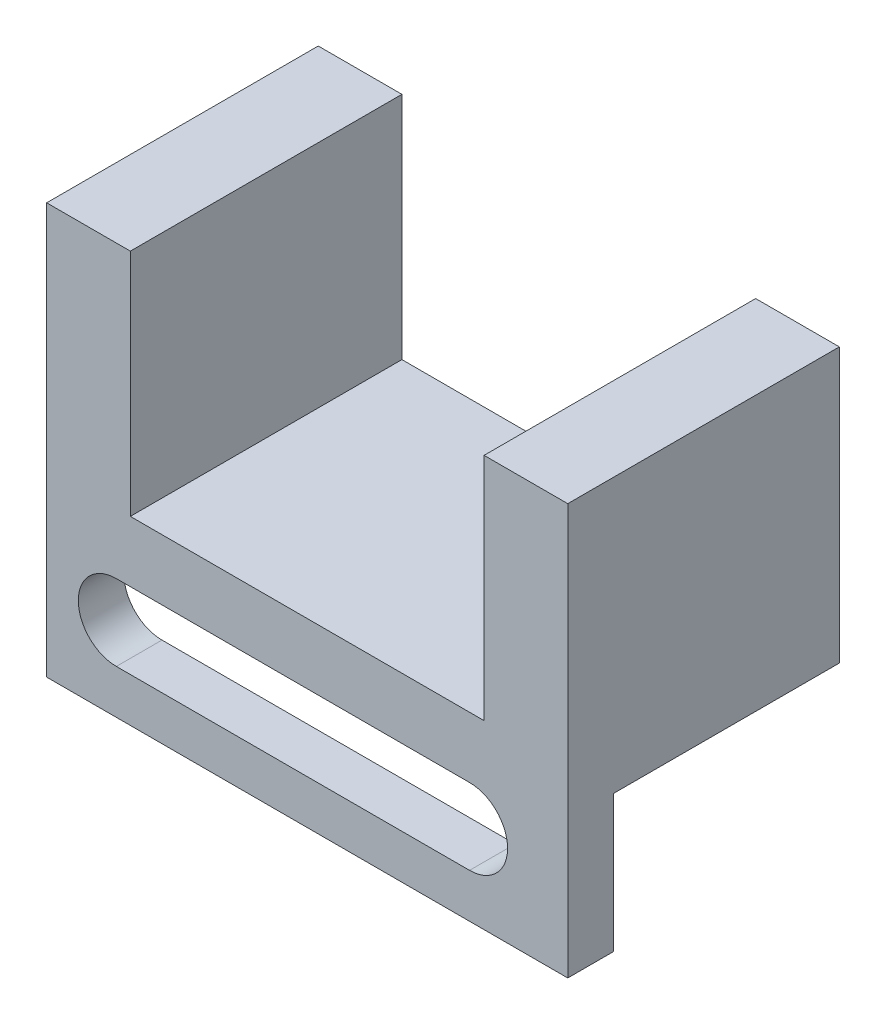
ISO-10303-21;
HEADER;
FILE_DESCRIPTION(('STEP AP214'),'2;1');
FILE_NAME('part.step','',(''),(''),'','','');
FILE_SCHEMA(('AUTOMOTIVE_DESIGN { 1 0 10303 214 1 1 1 1 }'));
ENDSEC;
DATA;
#1=APPLICATION_CONTEXT('core data for automotive mechanical design processes');
#2=APPLICATION_PROTOCOL_DEFINITION('international standard','automotive_design',2000,#1);
#3=PRODUCT_CONTEXT('',#1,'mechanical');
#4=PRODUCT('Part','Part','',(#3));
#5=PRODUCT_RELATED_PRODUCT_CATEGORY('part','',(#4));
#6=PRODUCT_DEFINITION_FORMATION('','',#4);
#7=PRODUCT_DEFINITION_CONTEXT('part definition',#1,'design');
#8=PRODUCT_DEFINITION('design','',#6,#7);
#9=PRODUCT_DEFINITION_SHAPE('','',#8);
#10=(LENGTH_UNIT() NAMED_UNIT(*) SI_UNIT(.MILLI.,.METRE.));
#11=(NAMED_UNIT(*) PLANE_ANGLE_UNIT() SI_UNIT($,.RADIAN.));
#12=(NAMED_UNIT(*) SI_UNIT($,.STERADIAN.) SOLID_ANGLE_UNIT());
#13=UNCERTAINTY_MEASURE_WITH_UNIT(LENGTH_MEASURE(1.E-05),#10,'distance_accuracy_value','');
#14=(GEOMETRIC_REPRESENTATION_CONTEXT(3) GLOBAL_UNCERTAINTY_ASSIGNED_CONTEXT((#13)) GLOBAL_UNIT_ASSIGNED_CONTEXT((#10,
#11,#12)) REPRESENTATION_CONTEXT('',''));
#15=CARTESIAN_POINT('',(0.,0.,0.));
#16=DIRECTION('',(0.,0.,1.));
#17=DIRECTION('',(1.,0.,0.));
#18=AXIS2_PLACEMENT_3D('',#15,#16,#17);
#19=CARTESIAN_POINT('',(40.3169177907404,78.6,-127.550100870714));
#20=DIRECTION('',(0.,1.,0.));
#21=DIRECTION('',(0.,0.,1.));
#22=AXIS2_PLACEMENT_3D('',#19,#20,#21);
#23=PLANE('',#22);
#24=DIRECTION('',(1.,0.,0.));
#25=VECTOR('',#24,1.);
#26=CARTESIAN_POINT('',(74.5669177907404,78.6,-73.6082089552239));
#27=LINE('',#26,#25);
#28=CARTESIAN_POINT('',(40.3169177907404,78.6,-73.6082089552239));
#29=VERTEX_POINT('',#28);
#30=CARTESIAN_POINT('',(74.5669177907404,78.6,-73.6082089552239));
#31=VERTEX_POINT('',#30);
#32=EDGE_CURVE('E64',#29,#31,#27,.T.);
#33=ORIENTED_EDGE('',*,*,#32,.F.);
#34=DIRECTION('',(0.,0.,1.));
#35=VECTOR('',#34,1.);
#36=CARTESIAN_POINT('',(40.3169177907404,78.6,-127.550100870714));
#37=LINE('',#36,#35);
#38=CARTESIAN_POINT('',(40.3169177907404,78.6,-88.4582089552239));
#39=VERTEX_POINT('',#38);
#40=EDGE_CURVE('E265',#39,#29,#37,.T.);
#41=ORIENTED_EDGE('',*,*,#40,.F.);
#42=DIRECTION('',(-1.,0.,0.));
#43=VECTOR('',#42,1.);
#44=CARTESIAN_POINT('',(40.3169177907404,78.6,-88.4582089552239));
#45=LINE('',#44,#43);
#46=CARTESIAN_POINT('',(74.5669177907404,78.6,-88.4582089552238));
#47=VERTEX_POINT('',#46);
#48=EDGE_CURVE('E287',#47,#39,#45,.T.);
#49=ORIENTED_EDGE('',*,*,#48,.F.);
#50=DIRECTION('',(0.,0.,1.));
#51=VECTOR('',#50,1.);
#52=CARTESIAN_POINT('',(74.5669177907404,78.6,-127.550100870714));
#53=LINE('',#52,#51);
#54=EDGE_CURVE('E269',#47,#31,#53,.T.);
#55=ORIENTED_EDGE('',*,*,#54,.T.);
#56=EDGE_LOOP('',(#33,#41,#49,#55));
#57=FACE_BOUND('',#56,.T.);
#58=ADVANCED_FACE('F46',(#57),#23,.F.);
#59=CARTESIAN_POINT('',(69.0669177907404,81.5,-127.550100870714));
#60=DIRECTION('',(1.,0.,0.));
#61=DIRECTION('',(0.,0.,-1.));
#62=AXIS2_PLACEMENT_3D('',#59,#60,#61);
#63=PLANE('',#62);
#64=DIRECTION('',(0.,1.,0.));
#65=VECTOR('',#64,1.);
#66=CARTESIAN_POINT('',(69.0669177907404,81.5,-88.4582089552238));
#67=LINE('',#66,#65);
#68=CARTESIAN_POINT('',(69.0669177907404,81.5,-88.4582089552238));
#69=VERTEX_POINT('',#68);
#70=CARTESIAN_POINT('',(69.0669177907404,96.6,-88.4582089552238));
#71=VERTEX_POINT('',#70);
#72=EDGE_CURVE('E299',#69,#71,#67,.T.);
#73=ORIENTED_EDGE('',*,*,#72,.F.);
#74=DIRECTION('',(0.,0.,1.));
#75=VECTOR('',#74,1.);
#76=CARTESIAN_POINT('',(69.0669177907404,81.5,-127.550100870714));
#77=LINE('',#76,#75);
#78=CARTESIAN_POINT('',(69.0669177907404,81.5,-70.6082089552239));
#79=VERTEX_POINT('',#78);
#80=EDGE_CURVE('E50',#69,#79,#77,.T.);
#81=ORIENTED_EDGE('',*,*,#80,.T.);
#82=DIRECTION('',(0.,1.,0.));
#83=VECTOR('',#82,1.);
#84=CARTESIAN_POINT('',(69.0669177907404,81.5,-70.6082089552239));
#85=LINE('',#84,#83);
#86=CARTESIAN_POINT('',(69.0669177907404,96.6,-70.6082089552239));
#87=VERTEX_POINT('',#86);
#88=EDGE_CURVE('E276',#79,#87,#85,.T.);
#89=ORIENTED_EDGE('',*,*,#88,.T.);
#90=DIRECTION('',(0.,0.,1.));
#91=VECTOR('',#90,1.);
#92=CARTESIAN_POINT('',(69.0669177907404,96.6,-127.550100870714));
#93=LINE('',#92,#91);
#94=EDGE_CURVE('E275',#71,#87,#93,.T.);
#95=ORIENTED_EDGE('',*,*,#94,.F.);
#96=EDGE_LOOP('',(#73,#81,#89,#95));
#97=FACE_BOUND('',#96,.T.);
#98=ADVANCED_FACE('F333',(#97),#63,.F.);
#99=CARTESIAN_POINT('',(74.5669177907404,96.6,-127.550100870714));
#100=DIRECTION('',(0.,-1.,0.));
#101=DIRECTION('',(0.,0.,-1.));
#102=AXIS2_PLACEMENT_3D('',#99,#100,#101);
#103=PLANE('',#102);
#104=DIRECTION('',(1.,0.,0.));
#105=VECTOR('',#104,1.);
#106=CARTESIAN_POINT('',(74.5669177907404,96.6,-88.4582089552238));
#107=LINE('',#106,#105);
#108=CARTESIAN_POINT('',(74.5669177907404,96.6,-88.4582089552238));
#109=VERTEX_POINT('',#108);
#110=EDGE_CURVE('E295',#71,#109,#107,.T.);
#111=ORIENTED_EDGE('',*,*,#110,.F.);
#112=ORIENTED_EDGE('',*,*,#94,.T.);
#113=DIRECTION('',(1.,0.,0.));
#114=VECTOR('',#113,1.);
#115=CARTESIAN_POINT('',(74.5669177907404,96.6,-70.6082089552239));
#116=LINE('',#115,#114);
#117=CARTESIAN_POINT('',(74.5669177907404,96.6,-70.6082089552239));
#118=VERTEX_POINT('',#117);
#119=EDGE_CURVE('E271',#87,#118,#116,.T.);
#120=ORIENTED_EDGE('',*,*,#119,.T.);
#121=DIRECTION('',(0.,0.,1.));
#122=VECTOR('',#121,1.);
#123=CARTESIAN_POINT('',(74.5669177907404,96.6,-127.550100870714));
#124=LINE('',#123,#122);
#125=EDGE_CURVE('E270',#109,#118,#124,.T.);
#126=ORIENTED_EDGE('',*,*,#125,.F.);
#127=EDGE_LOOP('',(#111,#112,#120,#126));
#128=FACE_BOUND('',#127,.T.);
#129=ADVANCED_FACE('F354',(#128),#103,.F.);
#130=CARTESIAN_POINT('',(74.5669177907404,78.6,-127.550100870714));
#131=DIRECTION('',(-1.,0.,0.));
#132=DIRECTION('',(0.,0.,1.));
#133=AXIS2_PLACEMENT_3D('',#130,#131,#132);
#134=PLANE('',#133);
#135=DIRECTION('',(0.,-1.,0.));
#136=VECTOR('',#135,1.);
#137=CARTESIAN_POINT('',(74.5669177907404,78.6,-88.4582089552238));
#138=LINE('',#137,#136);
#139=EDGE_CURVE('E291',#109,#47,#138,.T.);
#140=ORIENTED_EDGE('',*,*,#139,.F.);
#141=ORIENTED_EDGE('',*,*,#125,.T.);
#142=DIRECTION('',(0.,-1.,0.));
#143=VECTOR('',#142,1.);
#144=CARTESIAN_POINT('',(74.5669177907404,78.6,-70.6082089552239));
#145=LINE('',#144,#143);
#146=CARTESIAN_POINT('',(74.5669177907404,69.6,-70.6082089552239));
#147=VERTEX_POINT('',#146);
#148=EDGE_CURVE('E266',#118,#147,#145,.T.);
#149=ORIENTED_EDGE('',*,*,#148,.T.);
#150=DIRECTION('',(0.,0.,1.));
#151=VECTOR('',#150,1.);
#152=CARTESIAN_POINT('',(74.5669177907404,69.6,-73.6082089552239));
#153=LINE('',#152,#151);
#154=CARTESIAN_POINT('',(74.5669177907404,69.6,-73.6082089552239));
#155=VERTEX_POINT('',#154);
#156=EDGE_CURVE('E226',#155,#147,#153,.T.);
#157=ORIENTED_EDGE('',*,*,#156,.F.);
#158=DIRECTION('',(0.,-1.,0.));
#159=VECTOR('',#158,1.);
#160=CARTESIAN_POINT('',(74.5669177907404,78.6,-73.6082089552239));
#161=LINE('',#160,#159);
#162=EDGE_CURVE('E206',#31,#155,#161,.T.);
#163=ORIENTED_EDGE('',*,*,#162,.F.);
#164=ORIENTED_EDGE('',*,*,#54,.F.);
#165=EDGE_LOOP('',(#140,#141,#149,#157,#163,#164));
#166=FACE_BOUND('',#165,.T.);
#167=ADVANCED_FACE('F351',(#166),#134,.F.);
#168=CARTESIAN_POINT('',(40.3169177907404,96.6,-127.550100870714));
#169=DIRECTION('',(1.,0.,0.));
#170=DIRECTION('',(0.,1.,0.));
#171=AXIS2_PLACEMENT_3D('',#168,#169,#170);
#172=PLANE('',#171);
#173=DIRECTION('',(0.,1.,0.));
#174=VECTOR('',#173,1.);
#175=CARTESIAN_POINT('',(40.3169177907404,96.6,-88.4582089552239));
#176=LINE('',#175,#174);
#177=CARTESIAN_POINT('',(40.3169177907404,96.6,-88.4582089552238));
#178=VERTEX_POINT('',#177);
#179=EDGE_CURVE('E283',#39,#178,#176,.T.);
#180=ORIENTED_EDGE('',*,*,#179,.F.);
#181=ORIENTED_EDGE('',*,*,#40,.T.);
#182=DIRECTION('',(0.,1.,0.));
#183=VECTOR('',#182,1.);
#184=CARTESIAN_POINT('',(40.3169177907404,78.6,-73.6082089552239));
#185=LINE('',#184,#183);
#186=CARTESIAN_POINT('',(40.3169177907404,69.6,-73.6082089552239));
#187=VERTEX_POINT('',#186);
#188=EDGE_CURVE('E213',#187,#29,#185,.T.);
#189=ORIENTED_EDGE('',*,*,#188,.F.);
#190=DIRECTION('',(0.,0.,1.));
#191=VECTOR('',#190,1.);
#192=CARTESIAN_POINT('',(40.3169177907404,69.6,-73.6082089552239));
#193=LINE('',#192,#191);
#194=CARTESIAN_POINT('',(40.3169177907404,69.6,-70.6082089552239));
#195=VERTEX_POINT('',#194);
#196=EDGE_CURVE('E219',#187,#195,#193,.T.);
#197=ORIENTED_EDGE('',*,*,#196,.T.);
#198=DIRECTION('',(0.,1.,0.));
#199=VECTOR('',#198,1.);
#200=CARTESIAN_POINT('',(40.3169177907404,96.6,-70.6082089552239));
#201=LINE('',#200,#199);
#202=CARTESIAN_POINT('',(40.3169177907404,96.6,-70.6082089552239));
#203=VERTEX_POINT('',#202);
#204=EDGE_CURVE('E261',#195,#203,#201,.T.);
#205=ORIENTED_EDGE('',*,*,#204,.T.);
#206=DIRECTION('',(0.,0.,1.));
#207=VECTOR('',#206,1.);
#208=CARTESIAN_POINT('',(40.3169177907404,96.6,-127.550100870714));
#209=LINE('',#208,#207);
#210=EDGE_CURVE('E260',#178,#203,#209,.T.);
#211=ORIENTED_EDGE('',*,*,#210,.F.);
#212=EDGE_LOOP('',(#180,#181,#189,#197,#205,#211));
#213=FACE_BOUND('',#212,.T.);
#214=ADVANCED_FACE('F346',(#213),#172,.F.);
#215=CARTESIAN_POINT('',(45.8169177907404,96.6,-127.550100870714));
#216=DIRECTION('',(0.,-1.,0.));
#217=DIRECTION('',(0.,0.,-1.));
#218=AXIS2_PLACEMENT_3D('',#215,#216,#217);
#219=PLANE('',#218);
#220=DIRECTION('',(1.,0.,0.));
#221=VECTOR('',#220,1.);
#222=CARTESIAN_POINT('',(45.8169177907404,96.6,-88.4582089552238));
#223=LINE('',#222,#221);
#224=CARTESIAN_POINT('',(45.8169177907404,96.6,-88.4582089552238));
#225=VERTEX_POINT('',#224);
#226=EDGE_CURVE('E56',#178,#225,#223,.T.);
#227=ORIENTED_EDGE('',*,*,#226,.F.);
#228=ORIENTED_EDGE('',*,*,#210,.T.);
#229=DIRECTION('',(1.,0.,0.));
#230=VECTOR('',#229,1.);
#231=CARTESIAN_POINT('',(45.8169177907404,96.6,-70.6082089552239));
#232=LINE('',#231,#230);
#233=CARTESIAN_POINT('',(45.8169177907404,96.6,-70.6082089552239));
#234=VERTEX_POINT('',#233);
#235=EDGE_CURVE('E256',#203,#234,#232,.T.);
#236=ORIENTED_EDGE('',*,*,#235,.T.);
#237=DIRECTION('',(0.,0.,1.));
#238=VECTOR('',#237,1.);
#239=CARTESIAN_POINT('',(45.8169177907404,96.6,-127.550100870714));
#240=LINE('',#239,#238);
#241=EDGE_CURVE('E255',#225,#234,#240,.T.);
#242=ORIENTED_EDGE('',*,*,#241,.F.);
#243=EDGE_LOOP('',(#227,#228,#236,#242));
#244=FACE_BOUND('',#243,.T.);
#245=ADVANCED_FACE('F337',(#244),#219,.F.);
#246=CARTESIAN_POINT('',(45.8169177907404,81.5,-127.550100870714));
#247=DIRECTION('',(-1.,0.,0.));
#248=DIRECTION('',(0.,0.,1.));
#249=AXIS2_PLACEMENT_3D('',#246,#247,#248);
#250=PLANE('',#249);
#251=DIRECTION('',(0.,-1.,0.));
#252=VECTOR('',#251,1.);
#253=CARTESIAN_POINT('',(45.8169177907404,81.5,-88.4582089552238));
#254=LINE('',#253,#252);
#255=CARTESIAN_POINT('',(45.8169177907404,81.5,-88.4582089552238));
#256=VERTEX_POINT('',#255);
#257=EDGE_CURVE('E12',#225,#256,#254,.T.);
#258=ORIENTED_EDGE('',*,*,#257,.F.);
#259=ORIENTED_EDGE('',*,*,#241,.T.);
#260=DIRECTION('',(0.,-1.,0.));
#261=VECTOR('',#260,1.);
#262=CARTESIAN_POINT('',(45.8169177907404,81.5,-70.6082089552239));
#263=LINE('',#262,#261);
#264=CARTESIAN_POINT('',(45.8169177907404,81.5,-70.6082089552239));
#265=VERTEX_POINT('',#264);
#266=EDGE_CURVE('E251',#234,#265,#263,.T.);
#267=ORIENTED_EDGE('',*,*,#266,.T.);
#268=DIRECTION('',(0.,0.,1.));
#269=VECTOR('',#268,1.);
#270=CARTESIAN_POINT('',(45.8169177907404,81.5,-127.550100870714));
#271=LINE('',#270,#269);
#272=EDGE_CURVE('E250',#256,#265,#271,.T.);
#273=ORIENTED_EDGE('',*,*,#272,.F.);
#274=EDGE_LOOP('',(#258,#259,#267,#273));
#275=FACE_BOUND('',#274,.T.);
#276=ADVANCED_FACE('F323',(#275),#250,.F.);
#277=CARTESIAN_POINT('',(69.0669177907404,81.5,-127.550100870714));
#278=DIRECTION('',(0.,-1.,0.));
#279=DIRECTION('',(0.,0.,-1.));
#280=AXIS2_PLACEMENT_3D('',#277,#278,#279);
#281=PLANE('',#280);
#282=DIRECTION('',(1.,0.,0.));
#283=VECTOR('',#282,1.);
#284=CARTESIAN_POINT('',(69.0669177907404,81.5,-88.4582089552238));
#285=LINE('',#284,#283);
#286=EDGE_CURVE('E249',#256,#69,#285,.T.);
#287=ORIENTED_EDGE('',*,*,#286,.F.);
#288=ORIENTED_EDGE('',*,*,#272,.T.);
#289=DIRECTION('',(1.,0.,0.));
#290=VECTOR('',#289,1.);
#291=CARTESIAN_POINT('',(69.0669177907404,81.5,-70.6082089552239));
#292=LINE('',#291,#290);
#293=EDGE_CURVE('E246',#265,#79,#292,.T.);
#294=ORIENTED_EDGE('',*,*,#293,.T.);
#295=ORIENTED_EDGE('',*,*,#80,.F.);
#296=EDGE_LOOP('',(#287,#288,#294,#295));
#297=FACE_BOUND('',#296,.T.);
#298=ADVANCED_FACE('F318',(#297),#281,.F.);
#299=CARTESIAN_POINT('',(0.,0.,-70.6082089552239));
#300=DIRECTION('',(0.,0.,1.));
#301=DIRECTION('',(1.,0.,0.));
#302=AXIS2_PLACEMENT_3D('',#299,#300,#301);
#303=PLANE('',#302);
#304=ORIENTED_EDGE('',*,*,#88,.F.);
#305=ORIENTED_EDGE('',*,*,#293,.F.);
#306=ORIENTED_EDGE('',*,*,#266,.F.);
#307=ORIENTED_EDGE('',*,*,#235,.F.);
#308=ORIENTED_EDGE('',*,*,#204,.F.);
#309=DIRECTION('',(-1.,0.,0.));
#310=VECTOR('',#309,1.);
#311=CARTESIAN_POINT('',(74.5669177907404,69.6,-70.6082089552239));
#312=LINE('',#311,#310);
#313=EDGE_CURVE('E172',#147,#195,#312,.T.);
#314=ORIENTED_EDGE('',*,*,#313,.F.);
#315=ORIENTED_EDGE('',*,*,#148,.F.);
#316=ORIENTED_EDGE('',*,*,#119,.F.);
#317=EDGE_LOOP('',(#304,#305,#306,#307,#308,#314,#315,#316));
#318=FACE_BOUND('',#317,.T.);
#319=CARTESIAN_POINT('',(68.1119402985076,75.,-70.6082089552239));
#320=DIRECTION('',(0.,0.,-1.));
#321=DIRECTION('',(-1.,0.,0.));
#322=AXIS2_PLACEMENT_3D('',#319,#320,#321);
#323=CIRCLE('',#322,2.49999999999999);
#324=CARTESIAN_POINT('',(68.1119402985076,77.5,-70.6082089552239));
#325=VERTEX_POINT('',#324);
#326=CARTESIAN_POINT('',(68.1119402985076,72.5,-70.6082089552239));
#327=VERTEX_POINT('',#326);
#328=EDGE_CURVE('E187',#325,#327,#323,.T.);
#329=ORIENTED_EDGE('',*,*,#328,.T.);
#330=DIRECTION('',(-1.,0.,0.));
#331=VECTOR('',#330,1.);
#332=CARTESIAN_POINT('',(68.1119402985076,72.5,-70.6082089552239));
#333=LINE('',#332,#331);
#334=CARTESIAN_POINT('',(44.8968282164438,72.5,-70.6082089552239));
#335=VERTEX_POINT('',#334);
#336=EDGE_CURVE('E170',#327,#335,#333,.T.);
#337=ORIENTED_EDGE('',*,*,#336,.T.);
#338=CARTESIAN_POINT('',(44.8968282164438,75.,-70.6082089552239));
#339=DIRECTION('',(0.,0.,-1.));
#340=DIRECTION('',(-1.,0.,0.));
#341=AXIS2_PLACEMENT_3D('',#338,#339,#340);
#342=CIRCLE('',#341,2.49999999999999);
#343=CARTESIAN_POINT('',(44.8968282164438,77.5,-70.6082089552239));
#344=VERTEX_POINT('',#343);
#345=EDGE_CURVE('E192',#335,#344,#342,.T.);
#346=ORIENTED_EDGE('',*,*,#345,.T.);
#347=DIRECTION('',(1.,0.,0.));
#348=VECTOR('',#347,1.);
#349=CARTESIAN_POINT('',(68.1119402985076,77.5,-70.6082089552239));
#350=LINE('',#349,#348);
#351=EDGE_CURVE('E164',#344,#325,#350,.T.);
#352=ORIENTED_EDGE('',*,*,#351,.T.);
#353=EDGE_LOOP('',(#329,#337,#346,#352));
#354=FACE_BOUND('',#353,.T.);
#355=ADVANCED_FACE('F327',(#318,#354),#303,.T.);
#356=CARTESIAN_POINT('',(46.0669177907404,94.25,-88.4582089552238));
#357=DIRECTION('',(0.,0.,-1.));
#358=DIRECTION('',(0.,1.,0.));
#359=AXIS2_PLACEMENT_3D('',#356,#357,#358);
#360=PLANE('',#359);
#361=CARTESIAN_POINT('',(43.7419177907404,88.,-88.4582089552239));
#362=DIRECTION('',(0.,0.,-1.));
#363=DIRECTION('',(-1.,0.,0.));
#364=AXIS2_PLACEMENT_3D('',#361,#362,#363);
#365=CIRCLE('',#364,0.999999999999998);
#366=CARTESIAN_POINT('',(42.7419177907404,88.,-88.4582089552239));
#367=VERTEX_POINT('',#366);
#368=EDGE_CURVE('E235',#367,#367,#365,.T.);
#369=ORIENTED_EDGE('',*,*,#368,.F.);
#370=EDGE_LOOP('',(#369));
#371=FACE_BOUND('',#370,.T.);
#372=CARTESIAN_POINT('',(71.1419177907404,88.,-88.4582089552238));
#373=DIRECTION('',(0.,0.,-1.));
#374=DIRECTION('',(-1.,0.,0.));
#375=AXIS2_PLACEMENT_3D('',#372,#373,#374);
#376=CIRCLE('',#375,0.999999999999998);
#377=CARTESIAN_POINT('',(70.1419177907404,88.,-88.4582089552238));
#378=VERTEX_POINT('',#377);
#379=EDGE_CURVE('E239',#378,#378,#376,.T.);
#380=ORIENTED_EDGE('',*,*,#379,.F.);
#381=EDGE_LOOP('',(#380));
#382=FACE_BOUND('',#381,.T.);
#383=ORIENTED_EDGE('',*,*,#286,.T.);
#384=ORIENTED_EDGE('',*,*,#72,.T.);
#385=ORIENTED_EDGE('',*,*,#110,.T.);
#386=ORIENTED_EDGE('',*,*,#139,.T.);
#387=ORIENTED_EDGE('',*,*,#48,.T.);
#388=ORIENTED_EDGE('',*,*,#179,.T.);
#389=ORIENTED_EDGE('',*,*,#226,.T.);
#390=ORIENTED_EDGE('',*,*,#257,.T.);
#391=EDGE_LOOP('',(#383,#384,#385,#386,#387,#388,#389,#390));
#392=FACE_BOUND('',#391,.T.);
#393=ADVANCED_FACE('F48',(#371,#382,#392),#360,.T.);
#394=CARTESIAN_POINT('',(71.1419177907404,88.,-78.4582089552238));
#395=DIRECTION('',(0.,0.,-1.));
#396=DIRECTION('',(-1.,0.,0.));
#397=AXIS2_PLACEMENT_3D('',#394,#395,#396);
#398=CYLINDRICAL_SURFACE('',#397,0.999999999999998);
#399=CARTESIAN_POINT('',(71.1419177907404,88.,-78.4582089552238));
#400=DIRECTION('',(0.,0.,-1.));
#401=DIRECTION('',(-1.,0.,0.));
#402=AXIS2_PLACEMENT_3D('',#399,#400,#401);
#403=CIRCLE('',#402,0.999999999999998);
#404=CARTESIAN_POINT('',(70.1419177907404,88.,-78.4582089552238));
#405=VERTEX_POINT('',#404);
#406=EDGE_CURVE('E230',#405,#405,#403,.T.);
#407=ORIENTED_EDGE('',*,*,#406,.F.);
#408=EDGE_LOOP('',(#407));
#409=FACE_BOUND('',#408,.T.);
#410=ORIENTED_EDGE('',*,*,#379,.T.);
#411=EDGE_LOOP('',(#410));
#412=FACE_BOUND('',#411,.T.);
#413=ADVANCED_FACE('F401',(#409,#412),#398,.F.);
#414=CARTESIAN_POINT('',(71.1419177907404,88.,-78.4582089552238));
#415=DIRECTION('',(0.,0.,-1.));
#416=DIRECTION('',(-1.,0.,0.));
#417=AXIS2_PLACEMENT_3D('',#414,#415,#416);
#418=PLANE('',#417);
#419=ORIENTED_EDGE('',*,*,#406,.T.);
#420=EDGE_LOOP('',(#419));
#421=FACE_BOUND('',#420,.T.);
#422=ADVANCED_FACE('F409',(#421),#418,.T.);
#423=CARTESIAN_POINT('',(43.7419177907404,88.,-78.4582089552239));
#424=DIRECTION('',(0.,0.,-1.));
#425=DIRECTION('',(-1.,0.,0.));
#426=AXIS2_PLACEMENT_3D('',#423,#424,#425);
#427=CYLINDRICAL_SURFACE('',#426,0.999999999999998);
#428=CARTESIAN_POINT('',(43.7419177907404,88.,-78.4582089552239));
#429=DIRECTION('',(0.,0.,-1.));
#430=DIRECTION('',(-1.,0.,0.));
#431=AXIS2_PLACEMENT_3D('',#428,#429,#430);
#432=CIRCLE('',#431,0.999999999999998);
#433=CARTESIAN_POINT('',(42.7419177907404,88.,-78.4582089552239));
#434=VERTEX_POINT('',#433);
#435=EDGE_CURVE('E231',#434,#434,#432,.T.);
#436=ORIENTED_EDGE('',*,*,#435,.F.);
#437=EDGE_LOOP('',(#436));
#438=FACE_BOUND('',#437,.T.);
#439=ORIENTED_EDGE('',*,*,#368,.T.);
#440=EDGE_LOOP('',(#439));
#441=FACE_BOUND('',#440,.T.);
#442=ADVANCED_FACE('F418',(#438,#441),#427,.F.);
#443=CARTESIAN_POINT('',(43.7419177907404,88.,-78.4582089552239));
#444=DIRECTION('',(0.,0.,-1.));
#445=DIRECTION('',(-1.,0.,0.));
#446=AXIS2_PLACEMENT_3D('',#443,#444,#445);
#447=PLANE('',#446);
#448=ORIENTED_EDGE('',*,*,#435,.T.);
#449=EDGE_LOOP('',(#448));
#450=FACE_BOUND('',#449,.T.);
#451=ADVANCED_FACE('F426',(#450),#447,.T.);
#452=CARTESIAN_POINT('',(0.,0.,-73.6082089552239));
#453=DIRECTION('',(0.,0.,-1.));
#454=DIRECTION('',(-1.,0.,0.));
#455=AXIS2_PLACEMENT_3D('',#452,#453,#454);
#456=PLANE('',#455);
#457=ORIENTED_EDGE('',*,*,#162,.T.);
#458=DIRECTION('',(-1.,0.,0.));
#459=VECTOR('',#458,1.);
#460=CARTESIAN_POINT('',(74.5669177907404,69.6,-73.6082089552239));
#461=LINE('',#460,#459);
#462=EDGE_CURVE('E210',#155,#187,#461,.T.);
#463=ORIENTED_EDGE('',*,*,#462,.T.);
#464=ORIENTED_EDGE('',*,*,#188,.T.);
#465=ORIENTED_EDGE('',*,*,#32,.T.);
#466=EDGE_LOOP('',(#457,#463,#464,#465));
#467=FACE_BOUND('',#466,.T.);
#468=DIRECTION('',(-1.,0.,0.));
#469=VECTOR('',#468,1.);
#470=CARTESIAN_POINT('',(68.1119402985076,72.5,-73.6082089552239));
#471=LINE('',#470,#469);
#472=CARTESIAN_POINT('',(68.1119402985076,72.5,-73.6082089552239));
#473=VERTEX_POINT('',#472);
#474=CARTESIAN_POINT('',(44.8968282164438,72.5,-73.6082089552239));
#475=VERTEX_POINT('',#474);
#476=EDGE_CURVE('E163',#473,#475,#471,.T.);
#477=ORIENTED_EDGE('',*,*,#476,.F.);
#478=CARTESIAN_POINT('',(68.1119402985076,75.,-73.6082089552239));
#479=DIRECTION('',(0.,0.,-1.));
#480=DIRECTION('',(-1.,0.,0.));
#481=AXIS2_PLACEMENT_3D('',#478,#479,#480);
#482=CIRCLE('',#481,2.49999999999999);
#483=CARTESIAN_POINT('',(68.1119402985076,77.5,-73.6082089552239));
#484=VERTEX_POINT('',#483);
#485=EDGE_CURVE('E152',#484,#473,#482,.T.);
#486=ORIENTED_EDGE('',*,*,#485,.F.);
#487=DIRECTION('',(1.,0.,0.));
#488=VECTOR('',#487,1.);
#489=CARTESIAN_POINT('',(68.1119402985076,77.5,-73.6082089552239));
#490=LINE('',#489,#488);
#491=CARTESIAN_POINT('',(44.8968282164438,77.5,-73.6082089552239));
#492=VERTEX_POINT('',#491);
#493=EDGE_CURVE('E182',#492,#484,#490,.T.);
#494=ORIENTED_EDGE('',*,*,#493,.F.);
#495=CARTESIAN_POINT('',(44.8968282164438,75.,-73.6082089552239));
#496=DIRECTION('',(0.,0.,-1.));
#497=DIRECTION('',(-1.,0.,0.));
#498=AXIS2_PLACEMENT_3D('',#495,#496,#497);
#499=CIRCLE('',#498,2.49999999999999);
#500=EDGE_CURVE('E178',#475,#492,#499,.T.);
#501=ORIENTED_EDGE('',*,*,#500,.F.);
#502=EDGE_LOOP('',(#477,#486,#494,#501));
#503=FACE_BOUND('',#502,.T.);
#504=ADVANCED_FACE('F176',(#467,#503),#456,.T.);
#505=CARTESIAN_POINT('',(74.5669177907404,69.6,-73.6082089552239));
#506=DIRECTION('',(0.,1.,0.));
#507=DIRECTION('',(0.,0.,1.));
#508=AXIS2_PLACEMENT_3D('',#505,#506,#507);
#509=PLANE('',#508);
#510=ORIENTED_EDGE('',*,*,#313,.T.);
#511=ORIENTED_EDGE('',*,*,#196,.F.);
#512=ORIENTED_EDGE('',*,*,#462,.F.);
#513=ORIENTED_EDGE('',*,*,#156,.T.);
#514=EDGE_LOOP('',(#510,#511,#512,#513));
#515=FACE_BOUND('',#514,.T.);
#516=ADVANCED_FACE('F343',(#515),#509,.F.);
#517=CARTESIAN_POINT('',(68.1119402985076,75.,-73.6082089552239));
#518=DIRECTION('',(0.,0.,1.));
#519=DIRECTION('',(1.,0.,0.));
#520=AXIS2_PLACEMENT_3D('',#517,#518,#519);
#521=CYLINDRICAL_SURFACE('',#520,2.49999999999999);
#522=ORIENTED_EDGE('',*,*,#328,.F.);
#523=DIRECTION('',(0.,0.,1.));
#524=VECTOR('',#523,1.);
#525=CARTESIAN_POINT('',(68.1119402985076,77.5,-73.6082089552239));
#526=LINE('',#525,#524);
#527=EDGE_CURVE('E158',#484,#325,#526,.T.);
#528=ORIENTED_EDGE('',*,*,#527,.F.);
#529=ORIENTED_EDGE('',*,*,#485,.T.);
#530=DIRECTION('',(0.,0.,1.));
#531=VECTOR('',#530,1.);
#532=CARTESIAN_POINT('',(68.1119402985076,72.5,-73.6082089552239));
#533=LINE('',#532,#531);
#534=EDGE_CURVE('E155',#473,#327,#533,.T.);
#535=ORIENTED_EDGE('',*,*,#534,.T.);
#536=EDGE_LOOP('',(#522,#528,#529,#535));
#537=FACE_BOUND('',#536,.T.);
#538=ADVANCED_FACE('F154',(#537),#521,.F.);
#539=CARTESIAN_POINT('',(68.1119402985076,72.5,-73.6082089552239));
#540=DIRECTION('',(0.,1.,0.));
#541=DIRECTION('',(0.,0.,1.));
#542=AXIS2_PLACEMENT_3D('',#539,#540,#541);
#543=PLANE('',#542);
#544=ORIENTED_EDGE('',*,*,#336,.F.);
#545=ORIENTED_EDGE('',*,*,#534,.F.);
#546=ORIENTED_EDGE('',*,*,#476,.T.);
#547=DIRECTION('',(0.,0.,1.));
#548=VECTOR('',#547,1.);
#549=CARTESIAN_POINT('',(44.8968282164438,72.5,-73.6082089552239));
#550=LINE('',#549,#548);
#551=EDGE_CURVE('E173',#475,#335,#550,.T.);
#552=ORIENTED_EDGE('',*,*,#551,.T.);
#553=EDGE_LOOP('',(#544,#545,#546,#552));
#554=FACE_BOUND('',#553,.T.);
#555=ADVANCED_FACE('F167',(#554),#543,.T.);
#556=CARTESIAN_POINT('',(44.8968282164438,75.,-73.6082089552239));
#557=DIRECTION('',(0.,0.,1.));
#558=DIRECTION('',(1.,0.,0.));
#559=AXIS2_PLACEMENT_3D('',#556,#557,#558);
#560=CYLINDRICAL_SURFACE('',#559,2.49999999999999);
#561=ORIENTED_EDGE('',*,*,#345,.F.);
#562=ORIENTED_EDGE('',*,*,#551,.F.);
#563=ORIENTED_EDGE('',*,*,#500,.T.);
#564=DIRECTION('',(0.,0.,1.));
#565=VECTOR('',#564,1.);
#566=CARTESIAN_POINT('',(44.8968282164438,77.5,-73.6082089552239));
#567=LINE('',#566,#565);
#568=EDGE_CURVE('E201',#492,#344,#567,.T.);
#569=ORIENTED_EDGE('',*,*,#568,.T.);
#570=EDGE_LOOP('',(#561,#562,#563,#569));
#571=FACE_BOUND('',#570,.T.);
#572=ADVANCED_FACE('F498',(#571),#560,.F.);
#573=CARTESIAN_POINT('',(68.1119402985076,77.5,-73.6082089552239));
#574=DIRECTION('',(0.,-1.,0.));
#575=DIRECTION('',(0.,0.,-1.));
#576=AXIS2_PLACEMENT_3D('',#573,#574,#575);
#577=PLANE('',#576);
#578=ORIENTED_EDGE('',*,*,#351,.F.);
#579=ORIENTED_EDGE('',*,*,#568,.F.);
#580=ORIENTED_EDGE('',*,*,#493,.T.);
#581=ORIENTED_EDGE('',*,*,#527,.T.);
#582=EDGE_LOOP('',(#578,#579,#580,#581));
#583=FACE_BOUND('',#582,.T.);
#584=ADVANCED_FACE('F507',(#583),#577,.T.);
#585=CLOSED_SHELL('',(#58,#98,#129,#167,#214,#245,#276,#298,#355,#393,#413,#422,#442,#451,#504,
#516,#538,#555,#572,#584));
#586=MANIFOLD_SOLID_BREP('B2',#585);
#587=ADVANCED_BREP_SHAPE_REPRESENTATION('',(#18,#586),#14);
#588=SHAPE_DEFINITION_REPRESENTATION(#9,#587);
ENDSEC;
END-ISO-10303-21;
